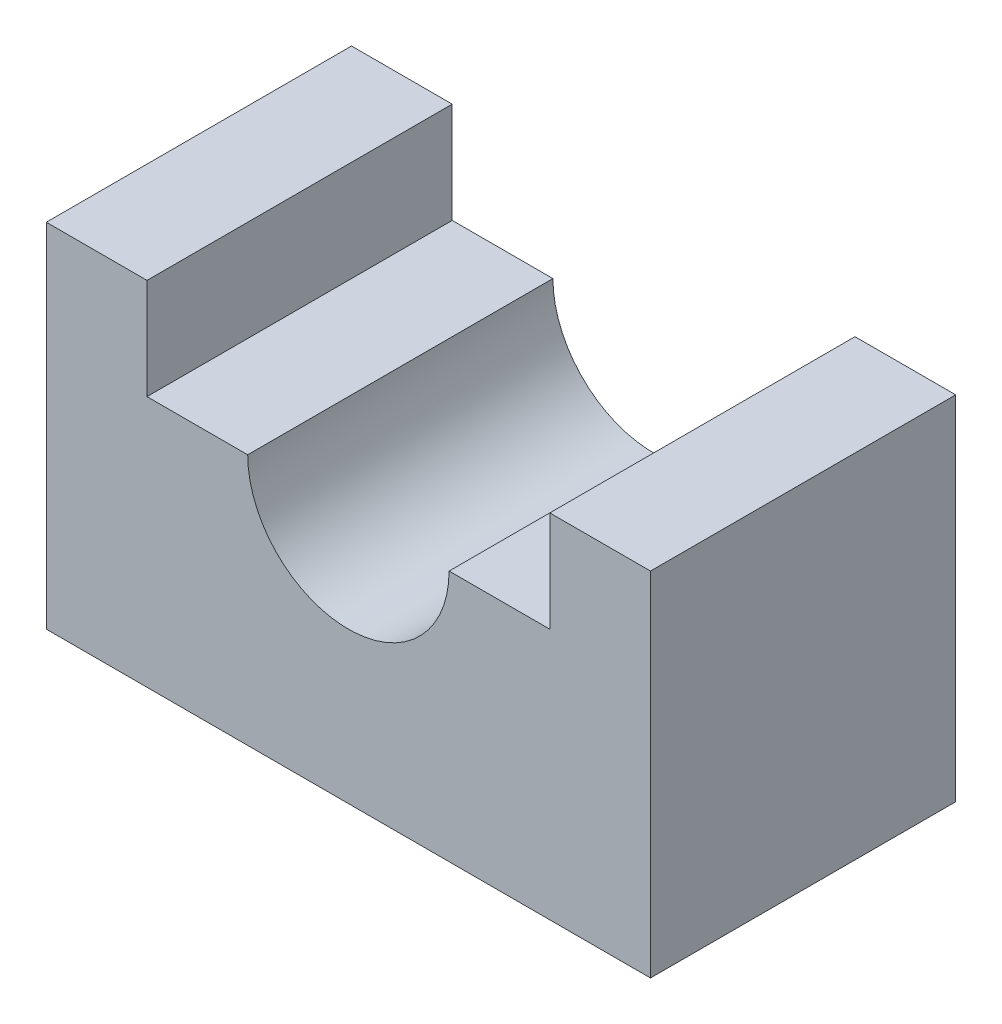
from build123d import *

# Parameters (mm, degrees)
EXTRUDE1_DEPTH = 15.155


with BuildPart() as part:
    # Sketch1 → Extrude1 (new, symmetric)
    with BuildSketch(Plane.XY):
        with BuildLine():
            Line((30, 0), (90, 0))
            Line((90, 0), (90, 35))
            Line((90, 35), (80, 35))
            Line((80, 35), (80, 25))
            Line((80, 25), (70, 25))
            ThreePointArc((70, 25), (60, 15), (50, 25))
            Line((50, 25), (40, 25))
            Line((40, 25), (40, 35))
            Line((40, 35), (30, 35))
            Line((30, 35), (30, 0))
        make_face()
    extrude(amount=EXTRUDE1_DEPTH, both=True)


solid = part.part
